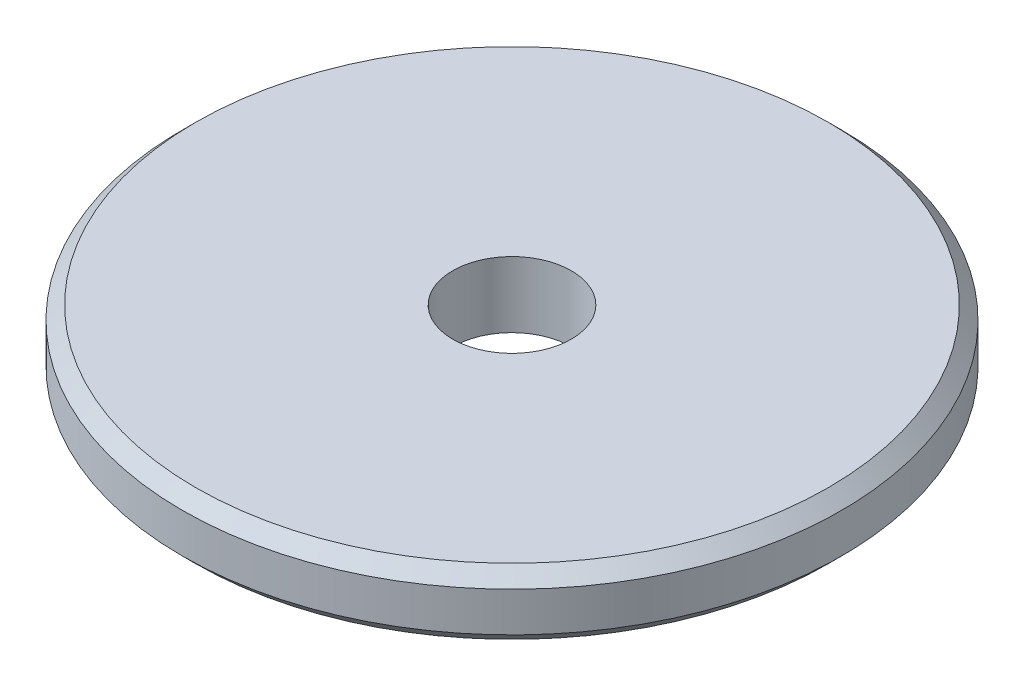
from build123d import *

# Parameters (mm, degrees)
SKETCH1_R      = 25
SKETCH1_R_2    = 4.5
EXTRUDE1_DEPTH = 5
CHAMFER1_SIZE  = 1


with BuildPart() as part:
    # Sketch1 → Extrude1 (new body)
    with BuildSketch(Plane(origin=(0, 0, 0), x_dir=(1, 0, 0), z_dir=(0, 1, 0))):
        with Locations(Location((0, 0, 0), (0, 0, 270))):
            Circle(SKETCH1_R)
        with Locations(Location((0, 0, 0), (0, 0, 270))):
            Circle(SKETCH1_R_2, mode=Mode.SUBTRACT)
    extrude(amount=EXTRUDE1_DEPTH)

    # Chamfer1
    chamfer1_edges = [part.edges().sort_by_distance(p)[0] for p in [
        (0, 0, -25),
        (0, 5, -25),
    ]]
    chamfer(chamfer1_edges, length=CHAMFER1_SIZE)


solid = part.part
